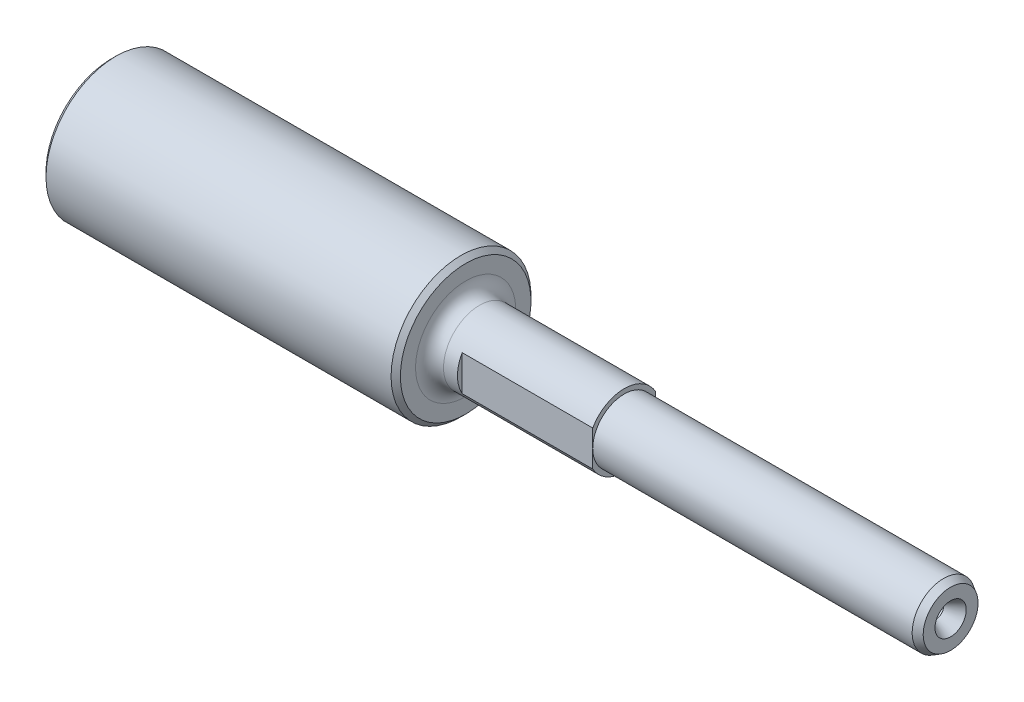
ISO-10303-21;
HEADER;
FILE_DESCRIPTION(('STEP AP214'),'2;1');
FILE_NAME('part.step','',(''),(''),'','','');
FILE_SCHEMA(('AUTOMOTIVE_DESIGN { 1 0 10303 214 1 1 1 1 }'));
ENDSEC;
DATA;
#1=APPLICATION_CONTEXT('core data for automotive mechanical design processes');
#2=APPLICATION_PROTOCOL_DEFINITION('international standard','automotive_design',2000,#1);
#3=PRODUCT_CONTEXT('',#1,'mechanical');
#4=PRODUCT('Part','Part','',(#3));
#5=PRODUCT_RELATED_PRODUCT_CATEGORY('part','',(#4));
#6=PRODUCT_DEFINITION_FORMATION('','',#4);
#7=PRODUCT_DEFINITION_CONTEXT('part definition',#1,'design');
#8=PRODUCT_DEFINITION('design','',#6,#7);
#9=PRODUCT_DEFINITION_SHAPE('','',#8);
#10=(LENGTH_UNIT() NAMED_UNIT(*) SI_UNIT(.MILLI.,.METRE.));
#11=(NAMED_UNIT(*) PLANE_ANGLE_UNIT() SI_UNIT($,.RADIAN.));
#12=(NAMED_UNIT(*) SI_UNIT($,.STERADIAN.) SOLID_ANGLE_UNIT());
#13=UNCERTAINTY_MEASURE_WITH_UNIT(LENGTH_MEASURE(1.E-05),#10,'distance_accuracy_value','');
#14=(GEOMETRIC_REPRESENTATION_CONTEXT(3) GLOBAL_UNCERTAINTY_ASSIGNED_CONTEXT((#13)) GLOBAL_UNIT_ASSIGNED_CONTEXT((#10,
#11,#12)) REPRESENTATION_CONTEXT('',''));
#15=CARTESIAN_POINT('',(0.,0.,0.));
#16=DIRECTION('',(0.,0.,1.));
#17=DIRECTION('',(1.,0.,0.));
#18=AXIS2_PLACEMENT_3D('',#15,#16,#17);
#19=CARTESIAN_POINT('',(0.,-6.75,0.));
#20=DIRECTION('',(-1.,0.,0.));
#21=DIRECTION('',(0.,0.,1.));
#22=AXIS2_PLACEMENT_3D('',#19,#20,#21);
#23=PLANE('',#22);
#24=CARTESIAN_POINT('',(0.,0.,0.));
#25=DIRECTION('',(-1.,0.,0.));
#26=DIRECTION('',(0.,0.,1.));
#27=AXIS2_PLACEMENT_3D('',#24,#25,#26);
#28=CIRCLE('',#27,7.75);
#29=CARTESIAN_POINT('',(0.,-3.80788655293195,-6.75));
#30=VERTEX_POINT('',#29);
#31=CARTESIAN_POINT('',(0.,-3.80788655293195,6.75));
#32=VERTEX_POINT('',#31);
#33=EDGE_CURVE('E58',#30,#32,#28,.T.);
#34=ORIENTED_EDGE('',*,*,#33,.F.);
#35=DIRECTION('',(0.,-1.,0.));
#36=VECTOR('',#35,1.);
#37=CARTESIAN_POINT('',(0.,3.80788655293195,-6.75));
#38=LINE('',#37,#36);
#39=CARTESIAN_POINT('',(0.,0.,-6.75));
#40=VERTEX_POINT('',#39);
#41=EDGE_CURVE('E96',#40,#30,#38,.T.);
#42=ORIENTED_EDGE('',*,*,#41,.F.);
#43=CARTESIAN_POINT('',(0.,0.,0.));
#44=DIRECTION('',(-1.,0.,0.));
#45=DIRECTION('',(0.,0.,1.));
#46=AXIS2_PLACEMENT_3D('',#43,#44,#45);
#47=CIRCLE('',#46,6.75);
#48=CARTESIAN_POINT('',(0.,0.,6.75));
#49=VERTEX_POINT('',#48);
#50=EDGE_CURVE('E127',#40,#49,#47,.T.);
#51=ORIENTED_EDGE('',*,*,#50,.T.);
#52=DIRECTION('',(0.,1.,0.));
#53=VECTOR('',#52,1.);
#54=CARTESIAN_POINT('',(0.,3.80788655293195,6.75));
#55=LINE('',#54,#53);
#56=EDGE_CURVE('E118',#32,#49,#55,.T.);
#57=ORIENTED_EDGE('',*,*,#56,.F.);
#58=EDGE_LOOP('',(#34,#42,#51,#57));
#59=FACE_BOUND('',#58,.T.);
#60=ADVANCED_FACE('F35',(#59),#23,.F.);
#61=CARTESIAN_POINT('',(70.,0.,0.));
#62=DIRECTION('',(-1.,0.,0.));
#63=DIRECTION('',(0.,0.,1.));
#64=AXIS2_PLACEMENT_3D('',#61,#62,#63);
#65=PLANE('',#64);
#66=CARTESIAN_POINT('',(70.,0.,0.));
#67=DIRECTION('',(1.,0.,0.));
#68=DIRECTION('',(0.,0.,-1.));
#69=AXIS2_PLACEMENT_3D('',#66,#67,#68);
#70=CIRCLE('',#69,3.35);
#71=CARTESIAN_POINT('',(70.,0.,-3.35));
#72=VERTEX_POINT('',#71);
#73=EDGE_CURVE('E102',#72,#72,#70,.T.);
#74=ORIENTED_EDGE('',*,*,#73,.F.);
#75=EDGE_LOOP('',(#74));
#76=FACE_BOUND('',#75,.T.);
#77=CARTESIAN_POINT('',(70.,0.,0.));
#78=DIRECTION('',(-1.,0.,0.));
#79=DIRECTION('',(0.,0.,1.));
#80=AXIS2_PLACEMENT_3D('',#77,#78,#79);
#81=CIRCLE('',#80,5.88397459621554);
#82=CARTESIAN_POINT('',(70.,0.,5.88397459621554));
#83=VERTEX_POINT('',#82);
#84=EDGE_CURVE('E138',#83,#83,#81,.F.);
#85=ORIENTED_EDGE('',*,*,#84,.T.);
#86=EDGE_LOOP('',(#85));
#87=FACE_BOUND('',#86,.T.);
#88=ADVANCED_FACE('F177',(#76,#87),#65,.F.);
#89=CARTESIAN_POINT('',(-110.,-15.,1.04744500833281E-13));
#90=DIRECTION('',(1.,0.,0.));
#91=DIRECTION('',(0.,0.,-1.));
#92=AXIS2_PLACEMENT_3D('',#89,#90,#91);
#93=PLANE('',#92);
#94=CARTESIAN_POINT('',(-110.,0.,0.));
#95=DIRECTION('',(1.,0.,0.));
#96=DIRECTION('',(0.,0.,-1.));
#97=AXIS2_PLACEMENT_3D('',#94,#95,#96);
#98=CIRCLE('',#97,14.);
#99=CARTESIAN_POINT('',(-110.,0.,-14.));
#100=VERTEX_POINT('',#99);
#101=EDGE_CURVE('E11',#100,#100,#98,.F.);
#102=ORIENTED_EDGE('',*,*,#101,.T.);
#103=EDGE_LOOP('',(#102));
#104=FACE_BOUND('',#103,.T.);
#105=ADVANCED_FACE('F167',(#104),#93,.F.);
#106=CARTESIAN_POINT('',(0.,0.,0.));
#107=DIRECTION('',(-1.,0.,0.));
#108=DIRECTION('',(0.,0.,1.));
#109=AXIS2_PLACEMENT_3D('',#106,#107,#108);
#110=CYLINDRICAL_SURFACE('',#109,15.);
#111=CARTESIAN_POINT('',(-35.,0.,0.));
#112=DIRECTION('',(-1.,0.,0.));
#113=DIRECTION('',(0.,0.,1.));
#114=AXIS2_PLACEMENT_3D('',#111,#112,#113);
#115=CIRCLE('',#114,15.);
#116=CARTESIAN_POINT('',(-35.,0.,15.));
#117=VERTEX_POINT('',#116);
#118=EDGE_CURVE('E150',#117,#117,#115,.T.);
#119=ORIENTED_EDGE('',*,*,#118,.T.);
#120=EDGE_LOOP('',(#119));
#121=FACE_BOUND('',#120,.T.);
#122=CARTESIAN_POINT('',(-109.,0.,0.));
#123=DIRECTION('',(1.,0.,0.));
#124=DIRECTION('',(0.,0.,-1.));
#125=AXIS2_PLACEMENT_3D('',#122,#123,#124);
#126=CIRCLE('',#125,15.);
#127=CARTESIAN_POINT('',(-109.,0.,-15.));
#128=VERTEX_POINT('',#127);
#129=EDGE_CURVE('E147',#128,#128,#126,.T.);
#130=ORIENTED_EDGE('',*,*,#129,.T.);
#131=EDGE_LOOP('',(#130));
#132=FACE_BOUND('',#131,.T.);
#133=ADVANCED_FACE('F164',(#121,#132),#110,.T.);
#134=CARTESIAN_POINT('',(-34.,-7.75,0.));
#135=DIRECTION('',(-1.,0.,0.));
#136=DIRECTION('',(0.,0.,1.));
#137=AXIS2_PLACEMENT_3D('',#134,#135,#136);
#138=PLANE('',#137);
#139=CARTESIAN_POINT('',(-34.,0.,0.));
#140=DIRECTION('',(-1.,0.,0.));
#141=DIRECTION('',(0.,0.,1.));
#142=AXIS2_PLACEMENT_3D('',#139,#140,#141);
#143=CIRCLE('',#142,13.9999999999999);
#144=CARTESIAN_POINT('',(-34.,0.,13.9999999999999));
#145=VERTEX_POINT('',#144);
#146=EDGE_CURVE('E43',#145,#145,#143,.F.);
#147=ORIENTED_EDGE('',*,*,#146,.T.);
#148=EDGE_LOOP('',(#147));
#149=FACE_BOUND('',#148,.T.);
#150=CARTESIAN_POINT('',(-34.,0.,0.));
#151=DIRECTION('',(-1.,0.,0.));
#152=DIRECTION('',(0.,0.,1.));
#153=AXIS2_PLACEMENT_3D('',#150,#151,#152);
#154=CIRCLE('',#153,10.75);
#155=CARTESIAN_POINT('',(-34.,0.,10.75));
#156=VERTEX_POINT('',#155);
#157=EDGE_CURVE('E141',#156,#156,#154,.T.);
#158=ORIENTED_EDGE('',*,*,#157,.T.);
#159=EDGE_LOOP('',(#158));
#160=FACE_BOUND('',#159,.T.);
#161=ADVANCED_FACE('F155',(#149,#160),#138,.F.);
#162=CARTESIAN_POINT('',(0.,0.,0.));
#163=DIRECTION('',(-1.,0.,0.));
#164=DIRECTION('',(0.,0.,1.));
#165=AXIS2_PLACEMENT_3D('',#162,#163,#164);
#166=CYLINDRICAL_SURFACE('',#165,7.75);
#167=CARTESIAN_POINT('',(0.,3.80788655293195,6.75));
#168=VERTEX_POINT('',#167);
#169=CARTESIAN_POINT('',(0.,3.80788655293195,-6.75));
#170=VERTEX_POINT('',#169);
#171=EDGE_CURVE('E132',#168,#170,#28,.T.);
#172=ORIENTED_EDGE('',*,*,#171,.T.);
#173=DIRECTION('',(1.,0.,0.));
#174=VECTOR('',#173,1.);
#175=CARTESIAN_POINT('',(-28.,3.80788655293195,-6.75));
#176=LINE('',#175,#174);
#177=CARTESIAN_POINT('',(-28.,3.80788655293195,-6.75));
#178=VERTEX_POINT('',#177);
#179=EDGE_CURVE('E50',#178,#170,#176,.T.);
#180=ORIENTED_EDGE('',*,*,#179,.F.);
#181=CARTESIAN_POINT('',(-28.,0.,0.));
#182=DIRECTION('',(1.,0.,0.));
#183=DIRECTION('',(0.,0.,-1.));
#184=AXIS2_PLACEMENT_3D('',#181,#182,#183);
#185=CIRCLE('',#184,7.75);
#186=CARTESIAN_POINT('',(-28.,-3.80788655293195,-6.75));
#187=VERTEX_POINT('',#186);
#188=EDGE_CURVE('E106',#187,#178,#185,.T.);
#189=ORIENTED_EDGE('',*,*,#188,.F.);
#190=DIRECTION('',(1.,0.,0.));
#191=VECTOR('',#190,1.);
#192=CARTESIAN_POINT('',(-28.,-3.80788655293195,-6.75));
#193=LINE('',#192,#191);
#194=EDGE_CURVE('E111',#187,#30,#193,.T.);
#195=ORIENTED_EDGE('',*,*,#194,.T.);
#196=ORIENTED_EDGE('',*,*,#33,.T.);
#197=DIRECTION('',(1.,0.,0.));
#198=VECTOR('',#197,1.);
#199=CARTESIAN_POINT('',(-28.,-3.80788655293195,6.75));
#200=LINE('',#199,#198);
#201=CARTESIAN_POINT('',(-28.,-3.80788655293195,6.75));
#202=VERTEX_POINT('',#201);
#203=EDGE_CURVE('E121',#202,#32,#200,.T.);
#204=ORIENTED_EDGE('',*,*,#203,.F.);
#205=CARTESIAN_POINT('',(-28.,0.,0.));
#206=DIRECTION('',(1.,0.,0.));
#207=DIRECTION('',(0.,0.,-1.));
#208=AXIS2_PLACEMENT_3D('',#205,#206,#207);
#209=CIRCLE('',#208,7.75);
#210=CARTESIAN_POINT('',(-28.,3.80788655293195,6.75));
#211=VERTEX_POINT('',#210);
#212=EDGE_CURVE('E115',#211,#202,#209,.T.);
#213=ORIENTED_EDGE('',*,*,#212,.F.);
#214=DIRECTION('',(1.,0.,0.));
#215=VECTOR('',#214,1.);
#216=CARTESIAN_POINT('',(-28.,3.80788655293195,6.75));
#217=LINE('',#216,#215);
#218=EDGE_CURVE('E124',#211,#168,#217,.T.);
#219=ORIENTED_EDGE('',*,*,#218,.T.);
#220=EDGE_LOOP('',(#172,#180,#189,#195,#196,#204,#213,#219));
#221=FACE_BOUND('',#220,.T.);
#222=CARTESIAN_POINT('',(-31.,0.,0.));
#223=DIRECTION('',(-1.,0.,0.));
#224=DIRECTION('',(0.,0.,1.));
#225=AXIS2_PLACEMENT_3D('',#222,#223,#224);
#226=CIRCLE('',#225,7.75);
#227=CARTESIAN_POINT('',(-31.,0.,7.75));
#228=VERTEX_POINT('',#227);
#229=EDGE_CURVE('E144',#228,#228,#226,.F.);
#230=ORIENTED_EDGE('',*,*,#229,.T.);
#231=EDGE_LOOP('',(#230));
#232=FACE_BOUND('',#231,.T.);
#233=ADVANCED_FACE('F194',(#221,#232),#166,.T.);
#234=EDGE_CURVE('E129',#49,#40,#47,.T.);
#235=ORIENTED_EDGE('',*,*,#234,.T.);
#236=EDGE_CURVE('E99',#170,#40,#38,.T.);
#237=ORIENTED_EDGE('',*,*,#236,.F.);
#238=ORIENTED_EDGE('',*,*,#171,.F.);
#239=EDGE_CURVE('E113',#49,#168,#55,.T.);
#240=ORIENTED_EDGE('',*,*,#239,.F.);
#241=EDGE_LOOP('',(#235,#237,#238,#240));
#242=FACE_BOUND('',#241,.T.);
#243=ADVANCED_FACE('F187',(#242),#23,.F.);
#244=CARTESIAN_POINT('',(0.,0.,0.));
#245=DIRECTION('',(-1.,0.,0.));
#246=DIRECTION('',(0.,0.,1.));
#247=AXIS2_PLACEMENT_3D('',#244,#245,#246);
#248=CYLINDRICAL_SURFACE('',#247,6.75);
#249=CARTESIAN_POINT('',(68.5,0.,0.));
#250=DIRECTION('',(-1.,0.,0.));
#251=DIRECTION('',(0.,0.,1.));
#252=AXIS2_PLACEMENT_3D('',#249,#250,#251);
#253=CIRCLE('',#252,6.75);
#254=CARTESIAN_POINT('',(68.5,0.,6.75));
#255=VERTEX_POINT('',#254);
#256=EDGE_CURVE('E135',#255,#255,#253,.T.);
#257=ORIENTED_EDGE('',*,*,#256,.T.);
#258=EDGE_LOOP('',(#257));
#259=FACE_BOUND('',#258,.T.);
#260=ORIENTED_EDGE('',*,*,#234,.F.);
#261=ORIENTED_EDGE('',*,*,#50,.F.);
#262=EDGE_LOOP('',(#260,#261));
#263=FACE_BOUND('',#262,.T.);
#264=ADVANCED_FACE('F193',(#259,#263),#248,.T.);
#265=CARTESIAN_POINT('',(68.5,0.,0.));
#266=DIRECTION('',(-1.,0.,0.));
#267=DIRECTION('',(0.,0.,1.));
#268=AXIS2_PLACEMENT_3D('',#265,#266,#267);
#269=CONICAL_SURFACE('',#268,6.75,0.523598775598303);
#270=ORIENTED_EDGE('',*,*,#84,.F.);
#271=EDGE_LOOP('',(#270));
#272=FACE_BOUND('',#271,.T.);
#273=ORIENTED_EDGE('',*,*,#256,.F.);
#274=EDGE_LOOP('',(#273));
#275=FACE_BOUND('',#274,.T.);
#276=ADVANCED_FACE('F200',(#272,#275),#269,.T.);
#277=CARTESIAN_POINT('',(-31.,0.,0.));
#278=DIRECTION('',(-1.,0.,0.));
#279=DIRECTION('',(0.,0.,1.));
#280=AXIS2_PLACEMENT_3D('',#277,#278,#279);
#281=TOROIDAL_SURFACE('',#280,10.75,3.);
#282=ORIENTED_EDGE('',*,*,#229,.F.);
#283=EDGE_LOOP('',(#282));
#284=FACE_BOUND('',#283,.T.);
#285=ORIENTED_EDGE('',*,*,#157,.F.);
#286=EDGE_LOOP('',(#285));
#287=FACE_BOUND('',#286,.T.);
#288=ADVANCED_FACE('F161',(#284,#287),#281,.F.);
#289=CARTESIAN_POINT('',(-35.,0.,0.));
#290=DIRECTION('',(-1.,0.,0.));
#291=DIRECTION('',(0.,0.,1.));
#292=AXIS2_PLACEMENT_3D('',#289,#290,#291);
#293=CONICAL_SURFACE('',#292,15.,0.785398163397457);
#294=ORIENTED_EDGE('',*,*,#146,.F.);
#295=EDGE_LOOP('',(#294));
#296=FACE_BOUND('',#295,.T.);
#297=ORIENTED_EDGE('',*,*,#118,.F.);
#298=EDGE_LOOP('',(#297));
#299=FACE_BOUND('',#298,.T.);
#300=ADVANCED_FACE('F158',(#296,#299),#293,.T.);
#301=CARTESIAN_POINT('',(-110.,0.,0.));
#302=DIRECTION('',(1.,0.,0.));
#303=DIRECTION('',(0.,0.,-1.));
#304=AXIS2_PLACEMENT_3D('',#301,#302,#303);
#305=CONICAL_SURFACE('',#304,14.,0.785398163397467);
#306=ORIENTED_EDGE('',*,*,#129,.F.);
#307=EDGE_LOOP('',(#306));
#308=FACE_BOUND('',#307,.T.);
#309=ORIENTED_EDGE('',*,*,#101,.F.);
#310=EDGE_LOOP('',(#309));
#311=FACE_BOUND('',#310,.T.);
#312=ADVANCED_FACE('F37',(#308,#311),#305,.T.);
#313=CARTESIAN_POINT('',(-28.,3.80788655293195,6.75));
#314=DIRECTION('',(0.,0.,-1.));
#315=DIRECTION('',(-1.,0.,0.));
#316=AXIS2_PLACEMENT_3D('',#313,#314,#315);
#317=PLANE('',#316);
#318=ORIENTED_EDGE('',*,*,#56,.T.);
#319=ORIENTED_EDGE('',*,*,#239,.T.);
#320=ORIENTED_EDGE('',*,*,#218,.F.);
#321=DIRECTION('',(0.,1.,0.));
#322=VECTOR('',#321,1.);
#323=CARTESIAN_POINT('',(-28.,3.80788655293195,6.75));
#324=LINE('',#323,#322);
#325=EDGE_CURVE('E117',#202,#211,#324,.T.);
#326=ORIENTED_EDGE('',*,*,#325,.F.);
#327=ORIENTED_EDGE('',*,*,#203,.T.);
#328=EDGE_LOOP('',(#318,#319,#320,#326,#327));
#329=FACE_BOUND('',#328,.T.);
#330=ADVANCED_FACE('F173',(#329),#317,.F.);
#331=CARTESIAN_POINT('',(-28.,0.,0.));
#332=DIRECTION('',(1.,0.,0.));
#333=DIRECTION('',(0.,0.,-1.));
#334=AXIS2_PLACEMENT_3D('',#331,#332,#333);
#335=PLANE('',#334);
#336=ORIENTED_EDGE('',*,*,#212,.T.);
#337=ORIENTED_EDGE('',*,*,#325,.T.);
#338=EDGE_LOOP('',(#336,#337));
#339=FACE_BOUND('',#338,.T.);
#340=ADVANCED_FACE('F214',(#339),#335,.T.);
#341=CARTESIAN_POINT('',(-28.,3.80788655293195,-6.75));
#342=DIRECTION('',(0.,0.,1.));
#343=DIRECTION('',(1.,0.,0.));
#344=AXIS2_PLACEMENT_3D('',#341,#342,#343);
#345=PLANE('',#344);
#346=ORIENTED_EDGE('',*,*,#236,.T.);
#347=ORIENTED_EDGE('',*,*,#41,.T.);
#348=ORIENTED_EDGE('',*,*,#194,.F.);
#349=DIRECTION('',(0.,-1.,0.));
#350=VECTOR('',#349,1.);
#351=CARTESIAN_POINT('',(-28.,3.80788655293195,-6.75));
#352=LINE('',#351,#350);
#353=EDGE_CURVE('E108',#178,#187,#352,.T.);
#354=ORIENTED_EDGE('',*,*,#353,.F.);
#355=ORIENTED_EDGE('',*,*,#179,.T.);
#356=EDGE_LOOP('',(#346,#347,#348,#354,#355));
#357=FACE_BOUND('',#356,.T.);
#358=ADVANCED_FACE('F216',(#357),#345,.F.);
#359=CARTESIAN_POINT('',(-28.,0.,0.));
#360=DIRECTION('',(1.,0.,0.));
#361=DIRECTION('',(0.,0.,-1.));
#362=AXIS2_PLACEMENT_3D('',#359,#360,#361);
#363=PLANE('',#362);
#364=ORIENTED_EDGE('',*,*,#188,.T.);
#365=ORIENTED_EDGE('',*,*,#353,.T.);
#366=EDGE_LOOP('',(#364,#365));
#367=FACE_BOUND('',#366,.T.);
#368=ADVANCED_FACE('F90',(#367),#363,.T.);
#369=CARTESIAN_POINT('',(63.,0.,0.));
#370=DIRECTION('',(1.,0.,0.));
#371=DIRECTION('',(0.,0.,-1.));
#372=AXIS2_PLACEMENT_3D('',#369,#370,#371);
#373=CONICAL_SURFACE('',#372,1.575,1.02974425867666);
#374=CARTESIAN_POINT('',(62.0536445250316,0.,0.));
#375=VERTEX_POINT('',#374);
#376=VERTEX_LOOP('',#375);
#377=FACE_BOUND('',#376,.T.);
#378=CARTESIAN_POINT('',(63.,0.,0.));
#379=DIRECTION('',(1.,0.,0.));
#380=DIRECTION('',(0.,0.,-1.));
#381=AXIS2_PLACEMENT_3D('',#378,#379,#380);
#382=CIRCLE('',#381,1.575);
#383=CARTESIAN_POINT('',(63.,0.,-1.575));
#384=VERTEX_POINT('',#383);
#385=EDGE_CURVE('E94',#384,#384,#382,.T.);
#386=ORIENTED_EDGE('',*,*,#385,.T.);
#387=EDGE_LOOP('',(#386));
#388=FACE_BOUND('',#387,.T.);
#389=ADVANCED_FACE('F86',(#377,#388),#373,.F.);
#390=CARTESIAN_POINT('',(70.,0.,0.));
#391=DIRECTION('',(1.,0.,0.));
#392=DIRECTION('',(0.,0.,-1.));
#393=AXIS2_PLACEMENT_3D('',#390,#391,#392);
#394=CYLINDRICAL_SURFACE('',#393,1.575);
#395=ORIENTED_EDGE('',*,*,#385,.F.);
#396=EDGE_LOOP('',(#395));
#397=FACE_BOUND('',#396,.T.);
#398=CARTESIAN_POINT('',(66.9256098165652,0.,0.));
#399=DIRECTION('',(1.,0.,0.));
#400=DIRECTION('',(0.,0.,-1.));
#401=AXIS2_PLACEMENT_3D('',#398,#399,#400);
#402=CIRCLE('',#401,1.575);
#403=CARTESIAN_POINT('',(66.9256098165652,0.,-1.575));
#404=VERTEX_POINT('',#403);
#405=EDGE_CURVE('E97',#404,#404,#402,.T.);
#406=ORIENTED_EDGE('',*,*,#405,.T.);
#407=EDGE_LOOP('',(#406));
#408=FACE_BOUND('',#407,.T.);
#409=ADVANCED_FACE('F89',(#397,#408),#394,.F.);
#410=CARTESIAN_POINT('',(70.,0.,0.));
#411=DIRECTION('',(1.,0.,0.));
#412=DIRECTION('',(0.,0.,-1.));
#413=AXIS2_PLACEMENT_3D('',#410,#411,#412);
#414=CONICAL_SURFACE('',#413,3.35,0.523598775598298);
#415=ORIENTED_EDGE('',*,*,#405,.F.);
#416=EDGE_LOOP('',(#415));
#417=FACE_BOUND('',#416,.T.);
#418=ORIENTED_EDGE('',*,*,#73,.T.);
#419=EDGE_LOOP('',(#418));
#420=FACE_BOUND('',#419,.T.);
#421=ADVANCED_FACE('F230',(#417,#420),#414,.F.);
#422=CLOSED_SHELL('',(#60,#88,#105,#133,#161,#233,#243,#264,#276,#288,#300,#312,#330,#340,#358,
#368,#389,#409,#421));
#423=MANIFOLD_SOLID_BREP('B2',#422);
#424=ADVANCED_BREP_SHAPE_REPRESENTATION('',(#18,#423),#14);
#425=SHAPE_DEFINITION_REPRESENTATION(#9,#424);
ENDSEC;
END-ISO-10303-21;
